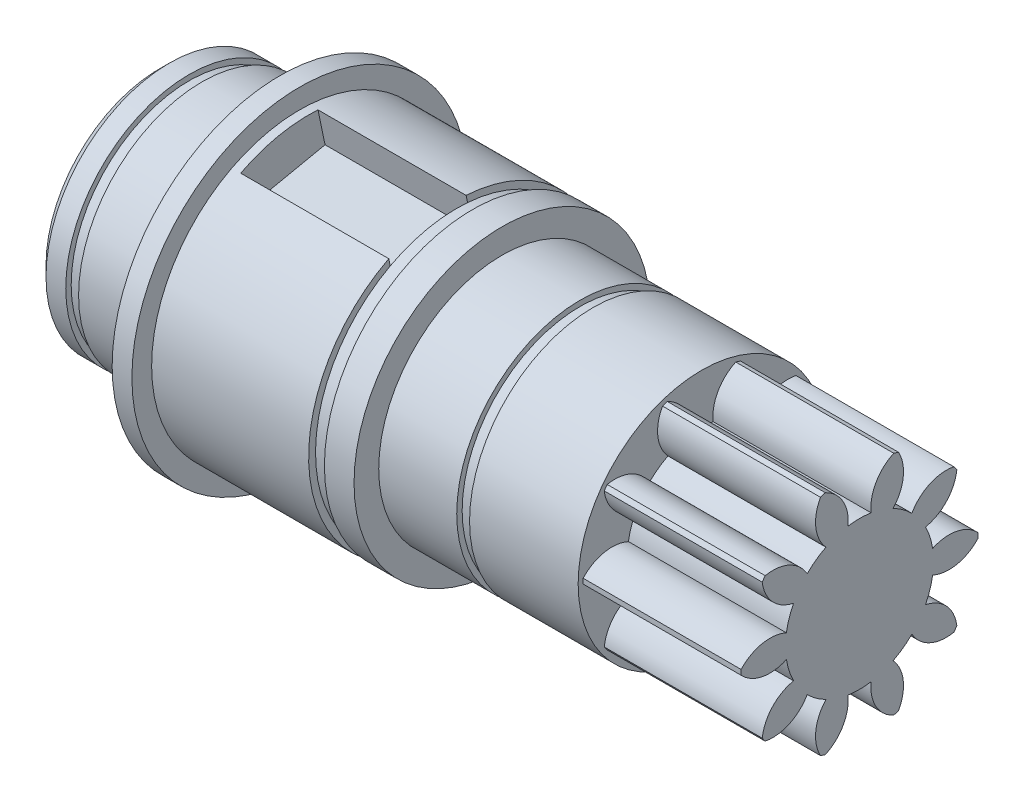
from build123d import *

# Parameters (mm, degrees)
BASPROSKE_W             = 16
BASPROSKE_H             = 12
TOOTHCUT_DEPTH          = 24.323807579
TEETHCUTS_COUNT         = 10
TEETHCUTS_ANGLE         = 324
BORSKE_R                = 7.4736
BORE_DEPTH              = 50.0000508
ESQUISSE1_R             = 7.4736
EXTRUSION2_DEPTH        = 16
ESQUISSE2_R             = 12.5
EXTRUSION3_DEPTH        = 11
ESQUISSE3_R             = 11.95
EXTRUSION4_DEPTH        = 1.3
ESQUISSE4_R             = 12.5
EXTRUSION5_DEPTH        = 7.9
ESQUISSE5_R             = 15
EXTRUSION6_DEPTH        = 3
ESQUISSE6_R             = 14.3
EXTRUSION7_DEPTH        = 1.6
ESQUISSE7_R             = 15
EXTRUSION8_DEPTH        = 15.9
ESQUISSE8_R             = 17
EXTRUSION9_DEPTH        = 2
ESQUISSE9_R             = 12.5
EXTRUSION11_DEPTH       = 7.9
ESQUISSE10_R            = 11.95
EXTRUSION12_DEPTH       = 1.3
ESQUISSE11_R            = 12.5
EXTRUSION13_DEPTH       = 3
CHANFREIN1_SIZE         = 1
ENL_V_MAT_EXTRU_1_DEPTH = 15


with BuildPart() as part:
    # BasProSke → Base-Revolve (revolve)
    with BuildSketch(Plane(origin=(0, 0, 0), x_dir=(1, 0, 0), z_dir=(0, 1, 0)), mode=Mode.PRIVATE) as base_revolve_sk:
        with Locations((8, 6)):
            Rectangle(BASPROSKE_W, BASPROSKE_H)
    revolve(base_revolve_sk.sketch.rotate(Axis((-10, 0, 0), (1, 0, 0)), 180), axis=Axis((-10, 0, 0), (1, 0, 0)))

    # TooCutSke → ToothCut (cut, through all)
    with BuildSketch(Plane(origin=(0, 0, 0), x_dir=(0, 0, -1), z_dir=(1, 0, 0))):
        with BuildLine():
            ThreePointArc((1.173662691, 7.406586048), (0, 7.499), (-1.173662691, 7.406586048))
            ThreePointArc((-1.173662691, 7.406586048), (-1.668191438, 9.834565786), (-3.497907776, 11.50542856))
            ThreePointArc((-3.497907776, 11.50542856), (0, 12.0254), (3.497907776, 11.50542856))
            ThreePointArc((3.497907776, 11.50542856), (1.668191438, 9.834565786), (1.173662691, 7.406586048))
        make_face()
    toothcut = extrude(amount=TOOTHCUT_DEPTH, mode=Mode.SUBTRACT)

    # TeethCuts: ToothCut ×10 about axis
    teethcuts_axis = Axis((-10, 0, 0), (1, 0, 0))
    for i in range(1, TEETHCUTS_COUNT):
        add(toothcut.rotate(teethcuts_axis, i * TEETHCUTS_ANGLE / (TEETHCUTS_COUNT - 1)), mode=Mode.SUBTRACT)

    # BorSke → Bore (cut, symmetric)
    with BuildSketch(Plane(origin=(0, 0, 0), x_dir=(0, 0, -1), z_dir=(1, 0, 0))):
        with Locations(Location((0, 0, 0), (0, 0, 180))):
            Circle(BORSKE_R)
    extrude(amount=BORE_DEPTH, both=True, mode=Mode.SUBTRACT)

    # Esquisse1 → Extrusion2 (add)
    with BuildSketch(Plane(origin=(16, 0, 0), x_dir=(0, 0, -1), z_dir=(1, 0, 0))):
        Circle(ESQUISSE1_R)
    extrude(amount=-EXTRUSION2_DEPTH)

    # Esquisse2 → Extrusion3 (add)
    with BuildSketch(Plane.ZY):
        Circle(ESQUISSE2_R)
    extrude(amount=EXTRUSION3_DEPTH)

    # Esquisse3 → Extrusion4 (add)
    with BuildSketch(Plane.ZY.offset(11)):
        Circle(ESQUISSE3_R)
    extrude(amount=EXTRUSION4_DEPTH)

    # Esquisse4 → Extrusion5 (add)
    with BuildSketch(Plane.ZY.offset(12.3)):
        Circle(ESQUISSE4_R)
    extrude(amount=EXTRUSION5_DEPTH)

    # Esquisse5 → Extrusion6 (add)
    with BuildSketch(Plane.ZY.offset(20.2)):
        Circle(ESQUISSE5_R)
    extrude(amount=EXTRUSION6_DEPTH)

    # Esquisse6 → Extrusion7 (add)
    with BuildSketch(Plane.ZY.offset(23.2)):
        Circle(ESQUISSE6_R)
    extrude(amount=EXTRUSION7_DEPTH)

    # Esquisse7 → Extrusion8 (add)
    with BuildSketch(Plane.ZY.offset(24.8)):
        Circle(ESQUISSE7_R)
    extrude(amount=EXTRUSION8_DEPTH)

    # Esquisse8 → Extrusion9 (add)
    with BuildSketch(Plane.ZY.offset(40.7)):
        Circle(ESQUISSE8_R)
    extrude(amount=EXTRUSION9_DEPTH)

    # Esquisse9 → Extrusion11 (add)
    with BuildSketch(Plane.ZY.offset(42.7)):
        Circle(ESQUISSE9_R)
    extrude(amount=EXTRUSION11_DEPTH)

    # Esquisse10 → Extrusion12 (add)
    with BuildSketch(Plane.ZY.offset(50.6)):
        Circle(ESQUISSE10_R)
    extrude(amount=EXTRUSION12_DEPTH)

    # Esquisse11 → Extrusion13 (add)
    with BuildSketch(Plane.ZY.offset(51.9)):
        Circle(ESQUISSE11_R)
    extrude(amount=EXTRUSION13_DEPTH)

    # Chanfrein1
    chanfrein1_edges = [part.edges().sort_by_distance(p)[0] for p in [
        (-54.9, 0, -12.5),
    ]]
    chamfer(chanfrein1_edges, length=CHANFREIN1_SIZE)

    # Esquisse12 → Enl_v. mat.-Extru.1 (cut)
    with BuildSketch(Plane(origin=(-24.8, 0, 0), x_dir=(0, 0, -1), z_dir=(1, 0, 0))):
        Polygon((0.228914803, 18.395527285), (1.665770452, 11.544582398), (-6.163880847, 9.902461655), (-7.600736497, 16.753406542), align=None)
    extrude(amount=-ENL_V_MAT_EXTRU_1_DEPTH, mode=Mode.SUBTRACT)


solid = part.part
